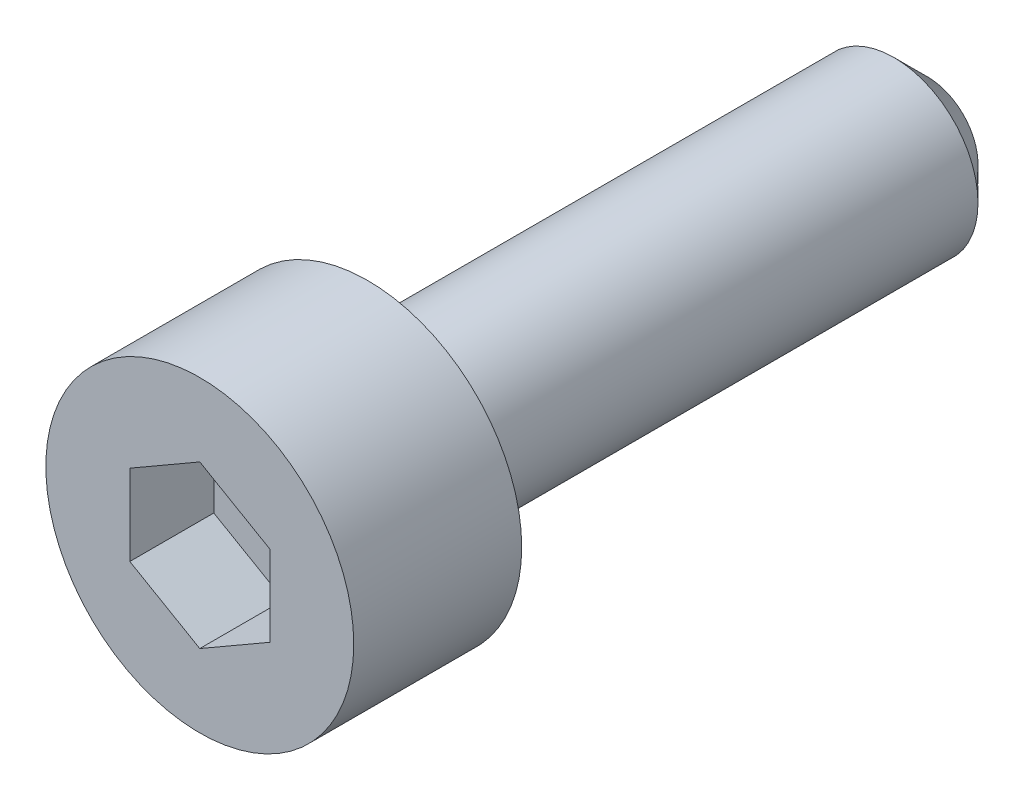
ISO-10303-21;
HEADER;
FILE_DESCRIPTION(('STEP AP214'),'2;1');
FILE_NAME('part.step','',(''),(''),'','','');
FILE_SCHEMA(('AUTOMOTIVE_DESIGN { 1 0 10303 214 1 1 1 1 }'));
ENDSEC;
DATA;
#1=APPLICATION_CONTEXT('core data for automotive mechanical design processes');
#2=APPLICATION_PROTOCOL_DEFINITION('international standard','automotive_design',2000,#1);
#3=PRODUCT_CONTEXT('',#1,'mechanical');
#4=PRODUCT('Part','Part','',(#3));
#5=PRODUCT_RELATED_PRODUCT_CATEGORY('part','',(#4));
#6=PRODUCT_DEFINITION_FORMATION('','',#4);
#7=PRODUCT_DEFINITION_CONTEXT('part definition',#1,'design');
#8=PRODUCT_DEFINITION('design','',#6,#7);
#9=PRODUCT_DEFINITION_SHAPE('','',#8);
#10=(LENGTH_UNIT() NAMED_UNIT(*) SI_UNIT(.MILLI.,.METRE.));
#11=(NAMED_UNIT(*) PLANE_ANGLE_UNIT() SI_UNIT($,.RADIAN.));
#12=(NAMED_UNIT(*) SI_UNIT($,.STERADIAN.) SOLID_ANGLE_UNIT());
#13=UNCERTAINTY_MEASURE_WITH_UNIT(LENGTH_MEASURE(1.E-05),#10,'distance_accuracy_value','');
#14=(GEOMETRIC_REPRESENTATION_CONTEXT(3) GLOBAL_UNCERTAINTY_ASSIGNED_CONTEXT((#13)) GLOBAL_UNIT_ASSIGNED_CONTEXT((#10,
#11,#12)) REPRESENTATION_CONTEXT('',''));
#15=CARTESIAN_POINT('',(0.,0.,0.));
#16=DIRECTION('',(0.,0.,1.));
#17=DIRECTION('',(1.,0.,0.));
#18=AXIS2_PLACEMENT_3D('',#15,#16,#17);
#19=CARTESIAN_POINT('',(0.,1.44337567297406,1.5));
#20=DIRECTION('',(-0.5,-0.86602540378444,0.));
#21=DIRECTION('',(0.86602540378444,-0.5,0.));
#22=AXIS2_PLACEMENT_3D('',#19,#20,#21);
#23=PLANE('',#22);
#24=DIRECTION('',(0.,0.,1.));
#25=VECTOR('',#24,1.);
#26=CARTESIAN_POINT('',(1.25,0.721687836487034,1.5));
#27=LINE('',#26,#25);
#28=CARTESIAN_POINT('',(1.25,0.721687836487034,1.5));
#29=VERTEX_POINT('',#28);
#30=CARTESIAN_POINT('',(1.25,0.721687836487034,3.));
#31=VERTEX_POINT('',#30);
#32=EDGE_CURVE('E63',#29,#31,#27,.T.);
#33=ORIENTED_EDGE('',*,*,#32,.T.);
#34=DIRECTION('',(0.866025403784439,-0.5,0.));
#35=VECTOR('',#34,1.);
#36=CARTESIAN_POINT('',(0.,1.44337567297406,3.));
#37=LINE('',#36,#35);
#38=CARTESIAN_POINT('',(0.,1.44337567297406,3.));
#39=VERTEX_POINT('',#38);
#40=EDGE_CURVE('E29',#39,#31,#37,.T.);
#41=ORIENTED_EDGE('',*,*,#40,.F.);
#42=DIRECTION('',(0.,0.,1.));
#43=VECTOR('',#42,1.);
#44=CARTESIAN_POINT('',(0.,1.44337567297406,1.5));
#45=LINE('',#44,#43);
#46=CARTESIAN_POINT('',(0.,1.44337567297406,1.5));
#47=VERTEX_POINT('',#46);
#48=EDGE_CURVE('E33',#47,#39,#45,.T.);
#49=ORIENTED_EDGE('',*,*,#48,.F.);
#50=DIRECTION('',(0.866025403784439,-0.5,0.));
#51=VECTOR('',#50,1.);
#52=CARTESIAN_POINT('',(0.,1.44337567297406,1.5));
#53=LINE('',#52,#51);
#54=EDGE_CURVE('E65',#47,#29,#53,.T.);
#55=ORIENTED_EDGE('',*,*,#54,.T.);
#56=EDGE_LOOP('',(#33,#41,#49,#55));
#57=FACE_BOUND('',#56,.T.);
#58=ADVANCED_FACE('F14',(#57),#23,.T.);
#59=CARTESIAN_POINT('',(1.25,-0.721687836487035,1.5));
#60=DIRECTION('',(1.,0.,0.));
#61=DIRECTION('',(0.,1.,0.));
#62=AXIS2_PLACEMENT_3D('',#59,#60,#61);
#63=PLANE('',#62);
#64=DIRECTION('',(0.,0.,1.));
#65=VECTOR('',#64,1.);
#66=CARTESIAN_POINT('',(1.25,-0.721687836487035,1.5));
#67=LINE('',#66,#65);
#68=CARTESIAN_POINT('',(1.25,-0.721687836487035,1.5));
#69=VERTEX_POINT('',#68);
#70=CARTESIAN_POINT('',(1.25,-0.721687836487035,3.));
#71=VERTEX_POINT('',#70);
#72=EDGE_CURVE('E70',#69,#71,#67,.T.);
#73=ORIENTED_EDGE('',*,*,#72,.T.);
#74=DIRECTION('',(0.,1.,0.));
#75=VECTOR('',#74,1.);
#76=CARTESIAN_POINT('',(1.25,-0.721687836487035,3.));
#77=LINE('',#76,#75);
#78=EDGE_CURVE('E73',#71,#31,#77,.T.);
#79=ORIENTED_EDGE('',*,*,#78,.T.);
#80=ORIENTED_EDGE('',*,*,#32,.F.);
#81=DIRECTION('',(0.,1.,0.));
#82=VECTOR('',#81,1.);
#83=CARTESIAN_POINT('',(1.25,-0.721687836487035,1.5));
#84=LINE('',#83,#82);
#85=EDGE_CURVE('E100',#69,#29,#84,.T.);
#86=ORIENTED_EDGE('',*,*,#85,.F.);
#87=EDGE_LOOP('',(#73,#79,#80,#86));
#88=FACE_BOUND('',#87,.T.);
#89=ADVANCED_FACE('F74',(#88),#63,.F.);
#90=CARTESIAN_POINT('',(0.,-1.44337567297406,1.5));
#91=DIRECTION('',(0.5,-0.86602540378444,0.));
#92=DIRECTION('',(0.86602540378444,0.5,0.));
#93=AXIS2_PLACEMENT_3D('',#90,#91,#92);
#94=PLANE('',#93);
#95=DIRECTION('',(0.,0.,1.));
#96=VECTOR('',#95,1.);
#97=CARTESIAN_POINT('',(0.,-1.44337567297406,1.5));
#98=LINE('',#97,#96);
#99=CARTESIAN_POINT('',(0.,-1.44337567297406,1.5));
#100=VERTEX_POINT('',#99);
#101=CARTESIAN_POINT('',(0.,-1.44337567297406,3.));
#102=VERTEX_POINT('',#101);
#103=EDGE_CURVE('E108',#100,#102,#98,.T.);
#104=ORIENTED_EDGE('',*,*,#103,.T.);
#105=DIRECTION('',(0.86602540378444,0.5,0.));
#106=VECTOR('',#105,1.);
#107=CARTESIAN_POINT('',(0.,-1.44337567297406,3.));
#108=LINE('',#107,#106);
#109=EDGE_CURVE('E78',#102,#71,#108,.T.);
#110=ORIENTED_EDGE('',*,*,#109,.T.);
#111=ORIENTED_EDGE('',*,*,#72,.F.);
#112=DIRECTION('',(0.86602540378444,0.5,0.));
#113=VECTOR('',#112,1.);
#114=CARTESIAN_POINT('',(0.,-1.44337567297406,1.5));
#115=LINE('',#114,#113);
#116=EDGE_CURVE('E97',#100,#69,#115,.T.);
#117=ORIENTED_EDGE('',*,*,#116,.F.);
#118=EDGE_LOOP('',(#104,#110,#111,#117));
#119=FACE_BOUND('',#118,.T.);
#120=ADVANCED_FACE('F139',(#119),#94,.F.);
#121=CARTESIAN_POINT('',(0.,-1.44337567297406,1.5));
#122=DIRECTION('',(0.5,0.86602540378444,0.));
#123=DIRECTION('',(-0.86602540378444,0.5,0.));
#124=AXIS2_PLACEMENT_3D('',#121,#122,#123);
#125=PLANE('',#124);
#126=DIRECTION('',(0.,0.,1.));
#127=VECTOR('',#126,1.);
#128=CARTESIAN_POINT('',(-1.25,-0.721687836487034,1.5));
#129=LINE('',#128,#127);
#130=CARTESIAN_POINT('',(-1.25,-0.721687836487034,1.5));
#131=VERTEX_POINT('',#130);
#132=CARTESIAN_POINT('',(-1.25,-0.721687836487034,3.));
#133=VERTEX_POINT('',#132);
#134=EDGE_CURVE('E106',#131,#133,#129,.T.);
#135=ORIENTED_EDGE('',*,*,#134,.T.);
#136=DIRECTION('',(-0.86602540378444,0.5,0.));
#137=VECTOR('',#136,1.);
#138=CARTESIAN_POINT('',(0.,-1.44337567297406,3.));
#139=LINE('',#138,#137);
#140=EDGE_CURVE('E185',#102,#133,#139,.T.);
#141=ORIENTED_EDGE('',*,*,#140,.F.);
#142=ORIENTED_EDGE('',*,*,#103,.F.);
#143=DIRECTION('',(-0.86602540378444,0.5,0.));
#144=VECTOR('',#143,1.);
#145=CARTESIAN_POINT('',(0.,-1.44337567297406,1.5));
#146=LINE('',#145,#144);
#147=EDGE_CURVE('E94',#100,#131,#146,.T.);
#148=ORIENTED_EDGE('',*,*,#147,.T.);
#149=EDGE_LOOP('',(#135,#141,#142,#148));
#150=FACE_BOUND('',#149,.T.);
#151=ADVANCED_FACE('F151',(#150),#125,.T.);
#152=CARTESIAN_POINT('',(-1.25,0.721687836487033,1.5));
#153=DIRECTION('',(-1.,0.,0.));
#154=DIRECTION('',(0.,-1.,0.));
#155=AXIS2_PLACEMENT_3D('',#152,#153,#154);
#156=PLANE('',#155);
#157=DIRECTION('',(0.,0.,1.));
#158=VECTOR('',#157,1.);
#159=CARTESIAN_POINT('',(-1.25,0.721687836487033,1.5));
#160=LINE('',#159,#158);
#161=CARTESIAN_POINT('',(-1.25,0.721687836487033,1.5));
#162=VERTEX_POINT('',#161);
#163=CARTESIAN_POINT('',(-1.25,0.721687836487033,3.));
#164=VERTEX_POINT('',#163);
#165=EDGE_CURVE('E104',#162,#164,#160,.T.);
#166=ORIENTED_EDGE('',*,*,#165,.T.);
#167=DIRECTION('',(0.,-1.,0.));
#168=VECTOR('',#167,1.);
#169=CARTESIAN_POINT('',(-1.25,0.721687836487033,3.));
#170=LINE('',#169,#168);
#171=EDGE_CURVE('E186',#164,#133,#170,.T.);
#172=ORIENTED_EDGE('',*,*,#171,.T.);
#173=ORIENTED_EDGE('',*,*,#134,.F.);
#174=DIRECTION('',(0.,-1.,0.));
#175=VECTOR('',#174,1.);
#176=CARTESIAN_POINT('',(-1.25,0.721687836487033,1.5));
#177=LINE('',#176,#175);
#178=EDGE_CURVE('E91',#162,#131,#177,.T.);
#179=ORIENTED_EDGE('',*,*,#178,.F.);
#180=EDGE_LOOP('',(#166,#172,#173,#179));
#181=FACE_BOUND('',#180,.T.);
#182=ADVANCED_FACE('F147',(#181),#156,.F.);
#183=CARTESIAN_POINT('',(0.,1.44337567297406,1.5));
#184=DIRECTION('',(-0.5,0.86602540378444,0.));
#185=DIRECTION('',(-0.86602540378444,-0.5,0.));
#186=AXIS2_PLACEMENT_3D('',#183,#184,#185);
#187=PLANE('',#186);
#188=DIRECTION('',(-0.86602540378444,-0.5,0.));
#189=VECTOR('',#188,1.);
#190=CARTESIAN_POINT('',(0.,1.44337567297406,1.5));
#191=LINE('',#190,#189);
#192=EDGE_CURVE('E88',#47,#162,#191,.T.);
#193=ORIENTED_EDGE('',*,*,#192,.F.);
#194=ORIENTED_EDGE('',*,*,#48,.T.);
#195=DIRECTION('',(-0.86602540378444,-0.5,0.));
#196=VECTOR('',#195,1.);
#197=CARTESIAN_POINT('',(0.,1.44337567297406,3.));
#198=LINE('',#197,#196);
#199=EDGE_CURVE('E84',#39,#164,#198,.T.);
#200=ORIENTED_EDGE('',*,*,#199,.T.);
#201=ORIENTED_EDGE('',*,*,#165,.F.);
#202=EDGE_LOOP('',(#193,#194,#200,#201));
#203=FACE_BOUND('',#202,.T.);
#204=ADVANCED_FACE('F144',(#203),#187,.F.);
#205=CARTESIAN_POINT('',(1.25,0.721687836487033,1.5));
#206=DIRECTION('',(0.,0.,1.));
#207=DIRECTION('',(1.,0.,0.));
#208=AXIS2_PLACEMENT_3D('',#205,#206,#207);
#209=PLANE('',#208);
#210=ORIENTED_EDGE('',*,*,#54,.F.);
#211=ORIENTED_EDGE('',*,*,#192,.T.);
#212=ORIENTED_EDGE('',*,*,#178,.T.);
#213=ORIENTED_EDGE('',*,*,#147,.F.);
#214=ORIENTED_EDGE('',*,*,#116,.T.);
#215=ORIENTED_EDGE('',*,*,#85,.T.);
#216=EDGE_LOOP('',(#210,#211,#212,#213,#214,#215));
#217=FACE_BOUND('',#216,.T.);
#218=ADVANCED_FACE('F143',(#217),#209,.T.);
#219=CARTESIAN_POINT('',(0.,0.,3.));
#220=DIRECTION('',(0.,0.,1.));
#221=DIRECTION('',(1.,0.,0.));
#222=AXIS2_PLACEMENT_3D('',#219,#220,#221);
#223=PLANE('',#222);
#224=CARTESIAN_POINT('',(0.,0.,3.));
#225=DIRECTION('',(0.,0.,1.));
#226=DIRECTION('',(1.,0.,0.));
#227=AXIS2_PLACEMENT_3D('',#224,#225,#226);
#228=CIRCLE('',#227,2.75);
#229=CARTESIAN_POINT('',(2.75,0.,3.));
#230=VERTEX_POINT('',#229);
#231=EDGE_CURVE('E116',#230,#230,#228,.T.);
#232=ORIENTED_EDGE('',*,*,#231,.T.);
#233=EDGE_LOOP('',(#232));
#234=FACE_BOUND('',#233,.T.);
#235=ORIENTED_EDGE('',*,*,#199,.F.);
#236=ORIENTED_EDGE('',*,*,#40,.T.);
#237=ORIENTED_EDGE('',*,*,#78,.F.);
#238=ORIENTED_EDGE('',*,*,#109,.F.);
#239=ORIENTED_EDGE('',*,*,#140,.T.);
#240=ORIENTED_EDGE('',*,*,#171,.F.);
#241=EDGE_LOOP('',(#235,#236,#237,#238,#239,#240));
#242=FACE_BOUND('',#241,.T.);
#243=ADVANCED_FACE('F81',(#234,#242),#223,.T.);
#244=CARTESIAN_POINT('',(0.,0.,10.));
#245=DIRECTION('',(0.,0.,1.));
#246=DIRECTION('',(1.,0.,0.));
#247=AXIS2_PLACEMENT_3D('',#244,#245,#246);
#248=CYLINDRICAL_SURFACE('',#247,2.75);
#249=CARTESIAN_POINT('',(0.,0.,0.));
#250=DIRECTION('',(0.,0.,1.));
#251=DIRECTION('',(1.,0.,0.));
#252=AXIS2_PLACEMENT_3D('',#249,#250,#251);
#253=CIRCLE('',#252,2.75);
#254=CARTESIAN_POINT('',(2.75,0.,0.));
#255=VERTEX_POINT('',#254);
#256=EDGE_CURVE('E113',#255,#255,#253,.T.);
#257=ORIENTED_EDGE('',*,*,#256,.T.);
#258=EDGE_LOOP('',(#257));
#259=FACE_BOUND('',#258,.T.);
#260=ORIENTED_EDGE('',*,*,#231,.F.);
#261=EDGE_LOOP('',(#260));
#262=FACE_BOUND('',#261,.T.);
#263=ADVANCED_FACE('F164',(#259,#262),#248,.T.);
#264=CARTESIAN_POINT('',(2.75,0.,0.));
#265=DIRECTION('',(0.,0.,-1.));
#266=DIRECTION('',(-1.,0.,0.));
#267=AXIS2_PLACEMENT_3D('',#264,#265,#266);
#268=PLANE('',#267);
#269=CARTESIAN_POINT('',(0.,0.,0.));
#270=DIRECTION('',(0.,0.,1.));
#271=DIRECTION('',(1.,0.,0.));
#272=AXIS2_PLACEMENT_3D('',#269,#270,#271);
#273=CIRCLE('',#272,1.5);
#274=CARTESIAN_POINT('',(1.5,0.,0.));
#275=VERTEX_POINT('',#274);
#276=EDGE_CURVE('E69',#275,#275,#273,.T.);
#277=ORIENTED_EDGE('',*,*,#276,.T.);
#278=EDGE_LOOP('',(#277));
#279=FACE_BOUND('',#278,.T.);
#280=ORIENTED_EDGE('',*,*,#256,.F.);
#281=EDGE_LOOP('',(#280));
#282=FACE_BOUND('',#281,.T.);
#283=ADVANCED_FACE('F161',(#279,#282),#268,.T.);
#284=CARTESIAN_POINT('',(0.,0.,10.));
#285=DIRECTION('',(0.,0.,1.));
#286=DIRECTION('',(1.,0.,0.));
#287=AXIS2_PLACEMENT_3D('',#284,#285,#286);
#288=CYLINDRICAL_SURFACE('',#287,1.5);
#289=CARTESIAN_POINT('',(0.,0.,-9.4));
#290=DIRECTION('',(0.,0.,-1.));
#291=DIRECTION('',(-1.,0.,0.));
#292=AXIS2_PLACEMENT_3D('',#289,#290,#291);
#293=CIRCLE('',#292,1.5);
#294=CARTESIAN_POINT('',(-1.5,0.,-9.4));
#295=VERTEX_POINT('',#294);
#296=EDGE_CURVE('E22',#295,#295,#293,.F.);
#297=ORIENTED_EDGE('',*,*,#296,.T.);
#298=EDGE_LOOP('',(#297));
#299=FACE_BOUND('',#298,.T.);
#300=ORIENTED_EDGE('',*,*,#276,.F.);
#301=EDGE_LOOP('',(#300));
#302=FACE_BOUND('',#301,.T.);
#303=ADVANCED_FACE('F121',(#299,#302),#288,.T.);
#304=CARTESIAN_POINT('',(1.5,0.,-10.));
#305=DIRECTION('',(0.,0.,-1.));
#306=DIRECTION('',(-1.,0.,0.));
#307=AXIS2_PLACEMENT_3D('',#304,#305,#306);
#308=PLANE('',#307);
#309=CARTESIAN_POINT('',(0.,0.,-10.));
#310=DIRECTION('',(0.,0.,-1.));
#311=DIRECTION('',(-1.,0.,0.));
#312=AXIS2_PLACEMENT_3D('',#309,#310,#311);
#313=CIRCLE('',#312,0.9);
#314=CARTESIAN_POINT('',(-0.9,0.,-10.));
#315=VERTEX_POINT('',#314);
#316=EDGE_CURVE('E9',#315,#315,#313,.T.);
#317=ORIENTED_EDGE('',*,*,#316,.T.);
#318=EDGE_LOOP('',(#317));
#319=FACE_BOUND('',#318,.T.);
#320=ADVANCED_FACE('F125',(#319),#308,.T.);
#321=CARTESIAN_POINT('',(0.,0.,-9.4));
#322=DIRECTION('',(0.,0.,1.));
#323=DIRECTION('',(1.,0.,0.));
#324=AXIS2_PLACEMENT_3D('',#321,#322,#323);
#325=CONICAL_SURFACE('',#324,1.5,0.78539816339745);
#326=ORIENTED_EDGE('',*,*,#316,.F.);
#327=EDGE_LOOP('',(#326));
#328=FACE_BOUND('',#327,.T.);
#329=ORIENTED_EDGE('',*,*,#296,.F.);
#330=EDGE_LOOP('',(#329));
#331=FACE_BOUND('',#330,.T.);
#332=ADVANCED_FACE('F16',(#328,#331),#325,.T.);
#333=CLOSED_SHELL('',(#58,#89,#120,#151,#182,#204,#218,#243,#263,#283,#303,#320,#332));
#334=MANIFOLD_SOLID_BREP('B1',#333);
#335=ADVANCED_BREP_SHAPE_REPRESENTATION('',(#18,#334),#14);
#336=SHAPE_DEFINITION_REPRESENTATION(#9,#335);
ENDSEC;
END-ISO-10303-21;
